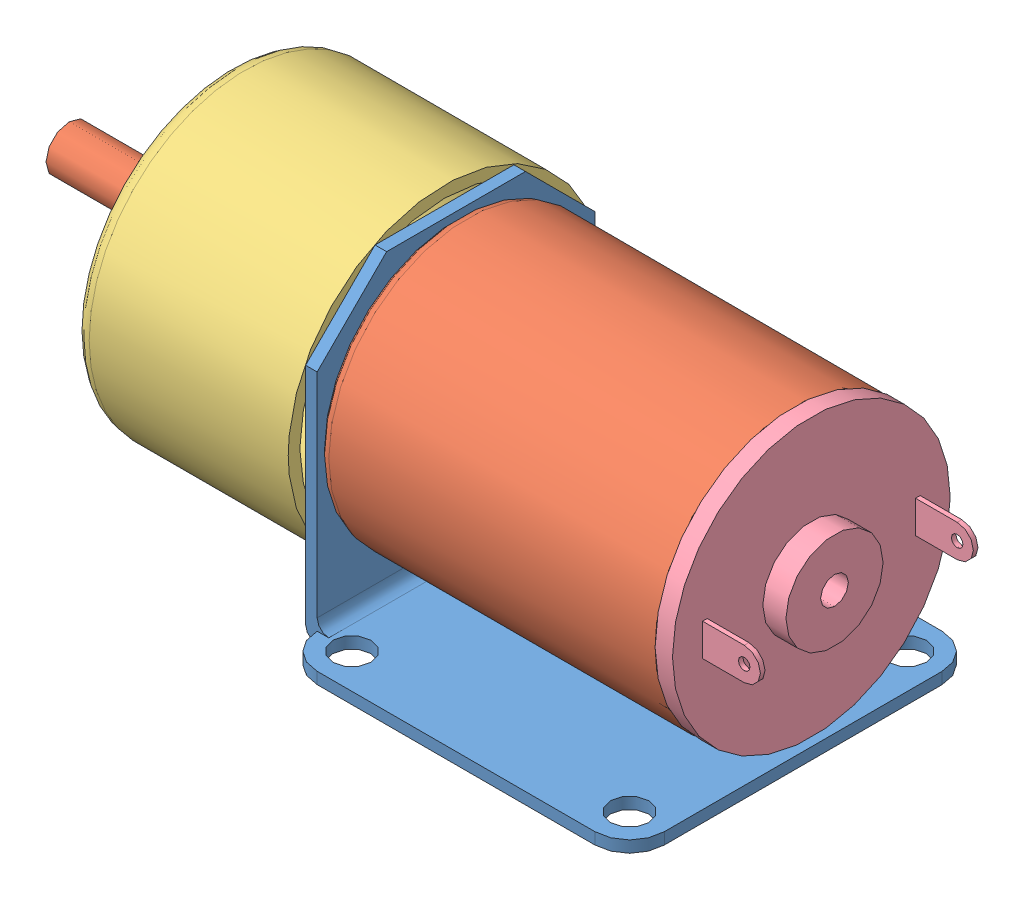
SolidWorks assembly Moteur MFA 918D.SLDASM, configuration Défaut (file format 7000). Lengths in mm.
Overall size (69.13 27.9 30).
4 component instances, 4 part files, 6 mates.
Components (placement in the parent):
- Support moteur-1: Support moteur.SLDPRT [Défaut] at (-14.3868 -12.5047 0) size (31 26.4 30)
- Corps moteur-1: Corps moteur.SLDPRT [Défaut] at (14.8132 1.8953 0) x (0 0 1) z (-1 0 0) size (24 24 62.63)
- Capuchon moteur-1: Capuchon moteur.SLDPRT [Défaut] at (-15.3868 1.8953 0) x (0 0 1) z (-1 0 0) size (27 27 18.7)
- Arrière moteur-1: Arrière moteur.SLDPRT [Défaut] at (16.3132 1.8953 0) x (0 0 1) z (-1 0 0) size (24 24 6.5)
Mates (geometry in assembly coordinates):
- Coïncidente1: coincident aligned: axis of Corps moteur-1 through (-13.3868 1.8953 0) axis (1 0 0); axis of Arrière moteur-1 through (14.8132 1.8953 0) axis (1 0 0)
- Coïncidente2: coincident anti-aligned: plane of Corps moteur-1 through (14.8132 1.8953 0) normal (1 0 0); plane of Arrière moteur-1 through (14.8132 1.8953 0) normal (-1 0 0)
- Coïncidente3: coincident anti-aligned: axis of Support moteur-1 through (-14.3868 1.8953 0) axis (-1 0 0); axis of Corps moteur-1 through (-37.8168 1.8953 0) axis (1 0 0)
- Coïncidente4: coincident anti-aligned: plane of Support moteur-1 through (-14.3868 -11.5047 -16.5358) normal (1 0 0); plane of Corps moteur-1 through (-14.3868 1.8953 0) normal (-1 0 0)
- Coïncidente5: coincident aligned: axis of Corps moteur-1 through (-37.8168 1.8953 0) axis (1 0 0); axis of Capuchon moteur-1 through (-32.5868 1.8953 0) axis (1 0 0)
- Coïncidente6: coincident anti-aligned: plane of Support moteur-1 through (-15.3868 13.8953 -12) normal (-1 0 0); plane of Capuchon moteur-1 through (-15.3868 1.8953 0) normal (1 0 0)
